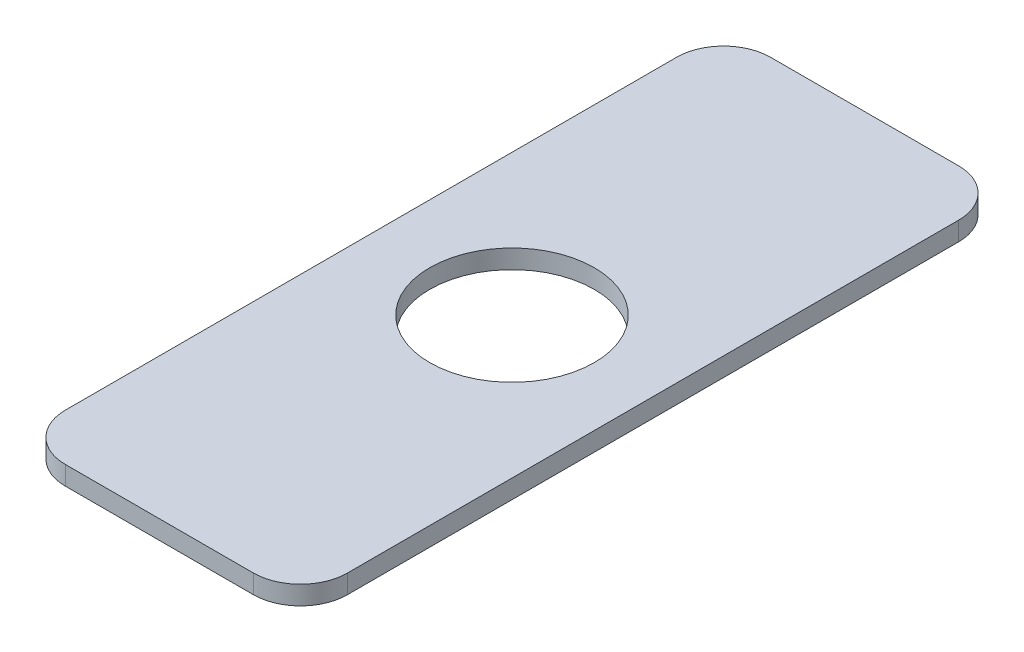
ISO-10303-21;
HEADER;
FILE_DESCRIPTION(('STEP AP214'),'2;1');
FILE_NAME('part.step','',(''),(''),'','','');
FILE_SCHEMA(('AUTOMOTIVE_DESIGN { 1 0 10303 214 1 1 1 1 }'));
ENDSEC;
DATA;
#1=APPLICATION_CONTEXT('core data for automotive mechanical design processes');
#2=APPLICATION_PROTOCOL_DEFINITION('international standard','automotive_design',2000,#1);
#3=PRODUCT_CONTEXT('',#1,'mechanical');
#4=PRODUCT('Part','Part','',(#3));
#5=PRODUCT_RELATED_PRODUCT_CATEGORY('part','',(#4));
#6=PRODUCT_DEFINITION_FORMATION('','',#4);
#7=PRODUCT_DEFINITION_CONTEXT('part definition',#1,'design');
#8=PRODUCT_DEFINITION('design','',#6,#7);
#9=PRODUCT_DEFINITION_SHAPE('','',#8);
#10=(LENGTH_UNIT() NAMED_UNIT(*) SI_UNIT(.MILLI.,.METRE.));
#11=(NAMED_UNIT(*) PLANE_ANGLE_UNIT() SI_UNIT($,.RADIAN.));
#12=(NAMED_UNIT(*) SI_UNIT($,.STERADIAN.) SOLID_ANGLE_UNIT());
#13=UNCERTAINTY_MEASURE_WITH_UNIT(LENGTH_MEASURE(1.E-05),#10,'distance_accuracy_value','');
#14=(GEOMETRIC_REPRESENTATION_CONTEXT(3) GLOBAL_UNCERTAINTY_ASSIGNED_CONTEXT((#13)) GLOBAL_UNIT_ASSIGNED_CONTEXT((#10,
#11,#12)) REPRESENTATION_CONTEXT('',''));
#15=CARTESIAN_POINT('',(0.,0.,0.));
#16=DIRECTION('',(0.,0.,1.));
#17=DIRECTION('',(1.,0.,0.));
#18=AXIS2_PLACEMENT_3D('',#15,#16,#17);
#19=CARTESIAN_POINT('',(30.,4.,-75.));
#20=DIRECTION('',(-1.,0.,0.));
#21=DIRECTION('',(0.,0.,1.));
#22=AXIS2_PLACEMENT_3D('',#19,#20,#21);
#23=PLANE('',#22);
#24=DIRECTION('',(0.,0.,-1.));
#25=VECTOR('',#24,1.);
#26=CARTESIAN_POINT('',(30.,0.,-75.));
#27=LINE('',#26,#25);
#28=CARTESIAN_POINT('',(30.,0.,65.));
#29=VERTEX_POINT('',#28);
#30=CARTESIAN_POINT('',(30.,0.,-65.));
#31=VERTEX_POINT('',#30);
#32=EDGE_CURVE('E140',#29,#31,#27,.T.);
#33=ORIENTED_EDGE('',*,*,#32,.T.);
#34=DIRECTION('',(0.,-1.,0.));
#35=VECTOR('',#34,1.);
#36=CARTESIAN_POINT('',(30.,4.,-65.));
#37=LINE('',#36,#35);
#38=CARTESIAN_POINT('',(30.,4.,-65.));
#39=VERTEX_POINT('',#38);
#40=EDGE_CURVE('E174',#31,#39,#37,.F.);
#41=ORIENTED_EDGE('',*,*,#40,.T.);
#42=DIRECTION('',(0.,0.,-1.));
#43=VECTOR('',#42,1.);
#44=CARTESIAN_POINT('',(30.,4.,-75.));
#45=LINE('',#44,#43);
#46=CARTESIAN_POINT('',(30.,4.,65.));
#47=VERTEX_POINT('',#46);
#48=EDGE_CURVE('E138',#47,#39,#45,.T.);
#49=ORIENTED_EDGE('',*,*,#48,.F.);
#50=DIRECTION('',(0.,-1.,0.));
#51=VECTOR('',#50,1.);
#52=CARTESIAN_POINT('',(30.,4.,65.));
#53=LINE('',#52,#51);
#54=EDGE_CURVE('E170',#47,#29,#53,.T.);
#55=ORIENTED_EDGE('',*,*,#54,.T.);
#56=EDGE_LOOP('',(#33,#41,#49,#55));
#57=FACE_BOUND('',#56,.T.);
#58=ADVANCED_FACE('F39',(#57),#23,.F.);
#59=CARTESIAN_POINT('',(-30.,4.,-75.));
#60=DIRECTION('',(0.,0.,1.));
#61=DIRECTION('',(1.,0.,0.));
#62=AXIS2_PLACEMENT_3D('',#59,#60,#61);
#63=PLANE('',#62);
#64=DIRECTION('',(-1.,0.,0.));
#65=VECTOR('',#64,1.);
#66=CARTESIAN_POINT('',(-30.,0.,-75.));
#67=LINE('',#66,#65);
#68=CARTESIAN_POINT('',(20.,0.,-75.));
#69=VERTEX_POINT('',#68);
#70=CARTESIAN_POINT('',(-20.,0.,-75.));
#71=VERTEX_POINT('',#70);
#72=EDGE_CURVE('E134',#69,#71,#67,.T.);
#73=ORIENTED_EDGE('',*,*,#72,.T.);
#74=DIRECTION('',(0.,-1.,0.));
#75=VECTOR('',#74,1.);
#76=CARTESIAN_POINT('',(-20.,4.,-75.));
#77=LINE('',#76,#75);
#78=CARTESIAN_POINT('',(-20.,4.,-75.));
#79=VERTEX_POINT('',#78);
#80=EDGE_CURVE('E110',#71,#79,#77,.F.);
#81=ORIENTED_EDGE('',*,*,#80,.T.);
#82=DIRECTION('',(-1.,0.,0.));
#83=VECTOR('',#82,1.);
#84=CARTESIAN_POINT('',(-30.,4.,-75.));
#85=LINE('',#84,#83);
#86=CARTESIAN_POINT('',(20.,4.,-75.));
#87=VERTEX_POINT('',#86);
#88=EDGE_CURVE('E193',#87,#79,#85,.T.);
#89=ORIENTED_EDGE('',*,*,#88,.F.);
#90=DIRECTION('',(0.,-1.,0.));
#91=VECTOR('',#90,1.);
#92=CARTESIAN_POINT('',(20.,4.,-75.));
#93=LINE('',#92,#91);
#94=EDGE_CURVE('E116',#87,#69,#93,.T.);
#95=ORIENTED_EDGE('',*,*,#94,.T.);
#96=EDGE_LOOP('',(#73,#81,#89,#95));
#97=FACE_BOUND('',#96,.T.);
#98=ADVANCED_FACE('F223',(#97),#63,.F.);
#99=CARTESIAN_POINT('',(-30.,4.,-75.));
#100=DIRECTION('',(1.,0.,0.));
#101=DIRECTION('',(0.,0.,-1.));
#102=AXIS2_PLACEMENT_3D('',#99,#100,#101);
#103=PLANE('',#102);
#104=DIRECTION('',(0.,0.,1.));
#105=VECTOR('',#104,1.);
#106=CARTESIAN_POINT('',(-30.,4.,-75.));
#107=LINE('',#106,#105);
#108=CARTESIAN_POINT('',(-30.,4.,-65.));
#109=VERTEX_POINT('',#108);
#110=CARTESIAN_POINT('',(-30.,4.,65.));
#111=VERTEX_POINT('',#110);
#112=EDGE_CURVE('E125',#109,#111,#107,.T.);
#113=ORIENTED_EDGE('',*,*,#112,.F.);
#114=DIRECTION('',(0.,-1.,0.));
#115=VECTOR('',#114,1.);
#116=CARTESIAN_POINT('',(-30.,4.,-65.));
#117=LINE('',#116,#115);
#118=CARTESIAN_POINT('',(-30.,0.,-65.));
#119=VERTEX_POINT('',#118);
#120=EDGE_CURVE('E109',#109,#119,#117,.T.);
#121=ORIENTED_EDGE('',*,*,#120,.T.);
#122=DIRECTION('',(0.,0.,1.));
#123=VECTOR('',#122,1.);
#124=CARTESIAN_POINT('',(-30.,0.,-75.));
#125=LINE('',#124,#123);
#126=CARTESIAN_POINT('',(-30.,0.,65.));
#127=VERTEX_POINT('',#126);
#128=EDGE_CURVE('E123',#119,#127,#125,.T.);
#129=ORIENTED_EDGE('',*,*,#128,.T.);
#130=DIRECTION('',(0.,-1.,0.));
#131=VECTOR('',#130,1.);
#132=CARTESIAN_POINT('',(-30.,4.,65.));
#133=LINE('',#132,#131);
#134=EDGE_CURVE('E128',#127,#111,#133,.F.);
#135=ORIENTED_EDGE('',*,*,#134,.T.);
#136=EDGE_LOOP('',(#113,#121,#129,#135));
#137=FACE_BOUND('',#136,.T.);
#138=ADVANCED_FACE('F122',(#137),#103,.F.);
#139=CARTESIAN_POINT('',(-30.,4.,75.));
#140=DIRECTION('',(0.,0.,-1.));
#141=DIRECTION('',(-1.,0.,0.));
#142=AXIS2_PLACEMENT_3D('',#139,#140,#141);
#143=PLANE('',#142);
#144=DIRECTION('',(1.,0.,0.));
#145=VECTOR('',#144,1.);
#146=CARTESIAN_POINT('',(-30.,0.,75.));
#147=LINE('',#146,#145);
#148=CARTESIAN_POINT('',(-20.,0.,75.));
#149=VERTEX_POINT('',#148);
#150=CARTESIAN_POINT('',(20.,0.,75.));
#151=VERTEX_POINT('',#150);
#152=EDGE_CURVE('E133',#149,#151,#147,.T.);
#153=ORIENTED_EDGE('',*,*,#152,.T.);
#154=DIRECTION('',(0.,-1.,0.));
#155=VECTOR('',#154,1.);
#156=CARTESIAN_POINT('',(20.,4.,75.));
#157=LINE('',#156,#155);
#158=CARTESIAN_POINT('',(20.,4.,75.));
#159=VERTEX_POINT('',#158);
#160=EDGE_CURVE('E11',#151,#159,#157,.F.);
#161=ORIENTED_EDGE('',*,*,#160,.T.);
#162=DIRECTION('',(1.,0.,0.));
#163=VECTOR('',#162,1.);
#164=CARTESIAN_POINT('',(-30.,4.,75.));
#165=LINE('',#164,#163);
#166=CARTESIAN_POINT('',(-20.,4.,75.));
#167=VERTEX_POINT('',#166);
#168=EDGE_CURVE('E145',#167,#159,#165,.T.);
#169=ORIENTED_EDGE('',*,*,#168,.F.);
#170=DIRECTION('',(0.,-1.,0.));
#171=VECTOR('',#170,1.);
#172=CARTESIAN_POINT('',(-20.,4.,75.));
#173=LINE('',#172,#171);
#174=EDGE_CURVE('E48',#167,#149,#173,.T.);
#175=ORIENTED_EDGE('',*,*,#174,.T.);
#176=EDGE_LOOP('',(#153,#161,#169,#175));
#177=FACE_BOUND('',#176,.T.);
#178=ADVANCED_FACE('F179',(#177),#143,.F.);
#179=CARTESIAN_POINT('',(0.,4.,0.));
#180=DIRECTION('',(0.,1.,0.));
#181=DIRECTION('',(0.,0.,1.));
#182=AXIS2_PLACEMENT_3D('',#179,#180,#181);
#183=PLANE('',#182);
#184=CARTESIAN_POINT('',(0.,4.,0.));
#185=DIRECTION('',(0.,1.,0.));
#186=DIRECTION('',(0.,0.,1.));
#187=AXIS2_PLACEMENT_3D('',#184,#185,#186);
#188=CIRCLE('',#187,17.5);
#189=CARTESIAN_POINT('',(0.,4.,17.5));
#190=VERTEX_POINT('',#189);
#191=EDGE_CURVE('E199',#190,#190,#188,.T.);
#192=ORIENTED_EDGE('',*,*,#191,.F.);
#193=EDGE_LOOP('',(#192));
#194=FACE_BOUND('',#193,.T.);
#195=ORIENTED_EDGE('',*,*,#88,.T.);
#196=CARTESIAN_POINT('',(-20.,4.,-65.));
#197=DIRECTION('',(0.,1.,0.));
#198=DIRECTION('',(0.,0.,1.));
#199=AXIS2_PLACEMENT_3D('',#196,#197,#198);
#200=CIRCLE('',#199,10.);
#201=EDGE_CURVE('E167',#79,#109,#200,.T.);
#202=ORIENTED_EDGE('',*,*,#201,.T.);
#203=ORIENTED_EDGE('',*,*,#112,.T.);
#204=CARTESIAN_POINT('',(-20.,4.,65.));
#205=DIRECTION('',(0.,1.,0.));
#206=DIRECTION('',(0.,0.,1.));
#207=AXIS2_PLACEMENT_3D('',#204,#205,#206);
#208=CIRCLE('',#207,10.);
#209=EDGE_CURVE('E60',#111,#167,#208,.T.);
#210=ORIENTED_EDGE('',*,*,#209,.T.);
#211=ORIENTED_EDGE('',*,*,#168,.T.);
#212=CARTESIAN_POINT('',(20.,4.,65.));
#213=DIRECTION('',(0.,1.,0.));
#214=DIRECTION('',(0.,0.,1.));
#215=AXIS2_PLACEMENT_3D('',#212,#213,#214);
#216=CIRCLE('',#215,10.);
#217=EDGE_CURVE('E161',#159,#47,#216,.T.);
#218=ORIENTED_EDGE('',*,*,#217,.T.);
#219=ORIENTED_EDGE('',*,*,#48,.T.);
#220=CARTESIAN_POINT('',(20.,4.,-65.));
#221=DIRECTION('',(0.,1.,0.));
#222=DIRECTION('',(0.,0.,1.));
#223=AXIS2_PLACEMENT_3D('',#220,#221,#222);
#224=CIRCLE('',#223,10.);
#225=EDGE_CURVE('E164',#39,#87,#224,.T.);
#226=ORIENTED_EDGE('',*,*,#225,.T.);
#227=EDGE_LOOP('',(#195,#202,#203,#210,#211,#218,#219,#226));
#228=FACE_BOUND('',#227,.T.);
#229=ADVANCED_FACE('F217',(#194,#228),#183,.T.);
#230=CARTESIAN_POINT('',(0.,0.,0.));
#231=DIRECTION('',(0.,1.,0.));
#232=DIRECTION('',(0.,0.,1.));
#233=AXIS2_PLACEMENT_3D('',#230,#231,#232);
#234=PLANE('',#233);
#235=CARTESIAN_POINT('',(0.,0.,0.));
#236=DIRECTION('',(0.,1.,0.));
#237=DIRECTION('',(0.,0.,1.));
#238=AXIS2_PLACEMENT_3D('',#235,#236,#237);
#239=CIRCLE('',#238,17.5);
#240=CARTESIAN_POINT('',(0.,0.,17.5));
#241=VERTEX_POINT('',#240);
#242=EDGE_CURVE('E206',#241,#241,#239,.T.);
#243=ORIENTED_EDGE('',*,*,#242,.T.);
#244=EDGE_LOOP('',(#243));
#245=FACE_BOUND('',#244,.T.);
#246=ORIENTED_EDGE('',*,*,#128,.F.);
#247=CARTESIAN_POINT('',(-20.,0.,-65.));
#248=DIRECTION('',(0.,1.,0.));
#249=DIRECTION('',(0.,0.,1.));
#250=AXIS2_PLACEMENT_3D('',#247,#248,#249);
#251=CIRCLE('',#250,10.);
#252=EDGE_CURVE('E105',#119,#71,#251,.F.);
#253=ORIENTED_EDGE('',*,*,#252,.T.);
#254=ORIENTED_EDGE('',*,*,#72,.F.);
#255=CARTESIAN_POINT('',(20.,0.,-65.));
#256=DIRECTION('',(0.,1.,0.));
#257=DIRECTION('',(0.,0.,1.));
#258=AXIS2_PLACEMENT_3D('',#255,#256,#257);
#259=CIRCLE('',#258,10.);
#260=EDGE_CURVE('E117',#69,#31,#259,.F.);
#261=ORIENTED_EDGE('',*,*,#260,.T.);
#262=ORIENTED_EDGE('',*,*,#32,.F.);
#263=CARTESIAN_POINT('',(20.,0.,65.));
#264=DIRECTION('',(0.,1.,0.));
#265=DIRECTION('',(0.,0.,1.));
#266=AXIS2_PLACEMENT_3D('',#263,#264,#265);
#267=CIRCLE('',#266,10.);
#268=EDGE_CURVE('E149',#29,#151,#267,.F.);
#269=ORIENTED_EDGE('',*,*,#268,.T.);
#270=ORIENTED_EDGE('',*,*,#152,.F.);
#271=CARTESIAN_POINT('',(-20.,0.,65.));
#272=DIRECTION('',(0.,1.,0.));
#273=DIRECTION('',(0.,0.,1.));
#274=AXIS2_PLACEMENT_3D('',#271,#272,#273);
#275=CIRCLE('',#274,10.);
#276=EDGE_CURVE('E127',#149,#127,#275,.F.);
#277=ORIENTED_EDGE('',*,*,#276,.T.);
#278=EDGE_LOOP('',(#246,#253,#254,#261,#262,#269,#270,#277));
#279=FACE_BOUND('',#278,.T.);
#280=ADVANCED_FACE('F130',(#245,#279),#234,.F.);
#281=CARTESIAN_POINT('',(-20.,4.,-65.));
#282=DIRECTION('',(0.,-1.,0.));
#283=DIRECTION('',(0.,0.,-1.));
#284=AXIS2_PLACEMENT_3D('',#281,#282,#283);
#285=CYLINDRICAL_SURFACE('',#284,10.);
#286=ORIENTED_EDGE('',*,*,#201,.F.);
#287=ORIENTED_EDGE('',*,*,#80,.F.);
#288=ORIENTED_EDGE('',*,*,#252,.F.);
#289=ORIENTED_EDGE('',*,*,#120,.F.);
#290=EDGE_LOOP('',(#286,#287,#288,#289));
#291=FACE_BOUND('',#290,.T.);
#292=ADVANCED_FACE('F108',(#291),#285,.T.);
#293=CARTESIAN_POINT('',(20.,4.,-65.));
#294=DIRECTION('',(0.,-1.,0.));
#295=DIRECTION('',(0.,0.,-1.));
#296=AXIS2_PLACEMENT_3D('',#293,#294,#295);
#297=CYLINDRICAL_SURFACE('',#296,10.);
#298=ORIENTED_EDGE('',*,*,#225,.F.);
#299=ORIENTED_EDGE('',*,*,#40,.F.);
#300=ORIENTED_EDGE('',*,*,#260,.F.);
#301=ORIENTED_EDGE('',*,*,#94,.F.);
#302=EDGE_LOOP('',(#298,#299,#300,#301));
#303=FACE_BOUND('',#302,.T.);
#304=ADVANCED_FACE('F225',(#303),#297,.T.);
#305=CARTESIAN_POINT('',(20.,4.,65.));
#306=DIRECTION('',(0.,-1.,0.));
#307=DIRECTION('',(0.,0.,-1.));
#308=AXIS2_PLACEMENT_3D('',#305,#306,#307);
#309=CYLINDRICAL_SURFACE('',#308,10.);
#310=ORIENTED_EDGE('',*,*,#217,.F.);
#311=ORIENTED_EDGE('',*,*,#160,.F.);
#312=ORIENTED_EDGE('',*,*,#268,.F.);
#313=ORIENTED_EDGE('',*,*,#54,.F.);
#314=EDGE_LOOP('',(#310,#311,#312,#313));
#315=FACE_BOUND('',#314,.T.);
#316=ADVANCED_FACE('F186',(#315),#309,.T.);
#317=CARTESIAN_POINT('',(-20.,4.,65.));
#318=DIRECTION('',(0.,-1.,0.));
#319=DIRECTION('',(0.,0.,-1.));
#320=AXIS2_PLACEMENT_3D('',#317,#318,#319);
#321=CYLINDRICAL_SURFACE('',#320,10.);
#322=ORIENTED_EDGE('',*,*,#209,.F.);
#323=ORIENTED_EDGE('',*,*,#134,.F.);
#324=ORIENTED_EDGE('',*,*,#276,.F.);
#325=ORIENTED_EDGE('',*,*,#174,.F.);
#326=EDGE_LOOP('',(#322,#323,#324,#325));
#327=FACE_BOUND('',#326,.T.);
#328=ADVANCED_FACE('F41',(#327),#321,.T.);
#329=CARTESIAN_POINT('',(0.,0.,0.));
#330=DIRECTION('',(0.,1.,0.));
#331=DIRECTION('',(0.,0.,1.));
#332=AXIS2_PLACEMENT_3D('',#329,#330,#331);
#333=CYLINDRICAL_SURFACE('',#332,17.5);
#334=ORIENTED_EDGE('',*,*,#242,.F.);
#335=EDGE_LOOP('',(#334));
#336=FACE_BOUND('',#335,.T.);
#337=ORIENTED_EDGE('',*,*,#191,.T.);
#338=EDGE_LOOP('',(#337));
#339=FACE_BOUND('',#338,.T.);
#340=ADVANCED_FACE('F215',(#336,#339),#333,.F.);
#341=CLOSED_SHELL('',(#58,#98,#138,#178,#229,#280,#292,#304,#316,#328,#340));
#342=MANIFOLD_SOLID_BREP('B2',#341);
#343=ADVANCED_BREP_SHAPE_REPRESENTATION('',(#18,#342),#14);
#344=SHAPE_DEFINITION_REPRESENTATION(#9,#343);
ENDSEC;
END-ISO-10303-21;
